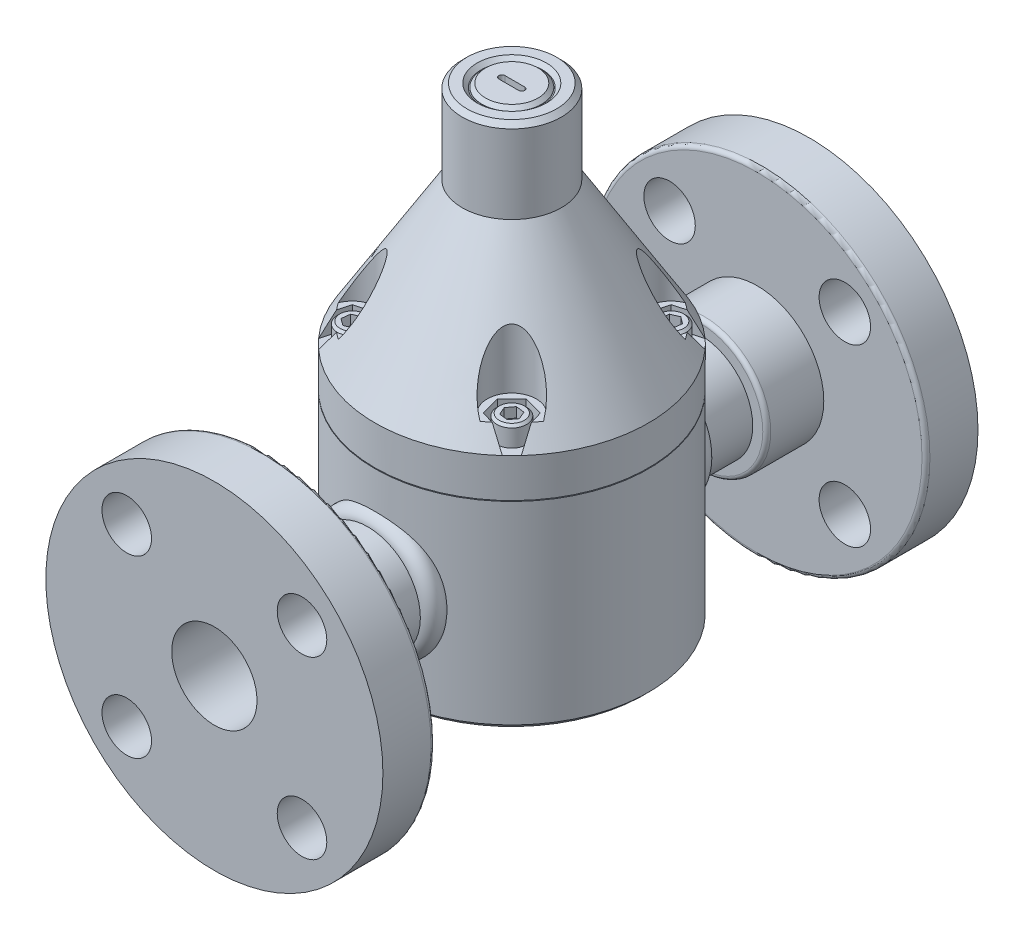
from build123d import *

# Parameters (mm, degrees)
SKETCH1_R                = 43.815
EXTRUDE1_DEPTH           = 148.59
CHAMFER1_SIZE            = 1.524
SKETCH3_R                = 11.1125
EXTRUDE2_DEPTH           = 1.27
EXTRUDE2_DRAFT           = -45
SKETCH4_R                = 9.525
EXTRUDE3_DEPTH           = 1.27
CHAMFER2_SIZE            = 1.143
EXTRUDE4_DEPTH           = 3.175
EXTRUDE4_DRAFT           = -1
SKETCH6_R                = 7.874
EXTRUDE5_DEPTH           = 22.86
EXTRUDE6_DEPTH           = 6.35
SKETCH8_R                = 4.7625
EXTRUDE7_DEPTH           = 6.35
EXTRUDE8_DEPTH           = 3.175
CIRPATTERN1_COUNT        = 4
CHAMFER3_SIZE            = 0.762
SKETCH10_R               = 53.975
BOSS_EXTRUDE1_DEPTH      = 16.6624
SKETCH11_R               = 21.4249
BOSS_EXTRUDE2_DEPTH      = 34.925
BOSS_EXTRUDE3_REACH      = 212.55
BOSS_EXTRUDE3_END_RADIUS = 43.815
SKETCH12_R               = 16.8275
SKETCH13_R               = 7.9375
CUT_EXTRUDE1_DEPTH       = 34.925
CIRPATTERN3_COUNT        = 4
SKETCH14_R               = 13.6525
CUT_EXTRUDE2_DEPTH       = 25.4
SKETCH15_R               = 54.046799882
BOSS_EXTRUDE4_DEPTH      = 16.6624
SKETCH16_R               = 21.323190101
BOSS_EXTRUDE5_DEPTH      = 34.925
BOSS_EXTRUDE6_REACH      = 249.569
BOSS_EXTRUDE6_END_RADIUS = 43.815
SKETCH17_R               = 16.8275
SKETCH18_R               = 8.236892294
CUT_EXTRUDE3_DEPTH       = 34.925
CIRPATTERN4_COUNT        = 4
FILLET1_R                = 1.27


with BuildPart() as part:
    # Sketch1 → Extrude1 (new body)
    with BuildSketch(Plane(origin=(0, 0, 0), x_dir=(1, 0, 0), z_dir=(0, 1, 0))):
        with Locations(Location((0, 0, 0), (0, 0, 270))):
            Circle(SKETCH1_R)
    extrude(amount=EXTRUDE1_DEPTH)

    # Sketch2 → Cut-Revolve1 (revolve, cut)
    with BuildSketch(Plane.XY, mode=Mode.PRIVATE) as cut_revolve1_sk:
        Polygon((-52.628834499, 63.5), (-30.226, 63.5), (-30.226, 63.754), (-43.815, 63.754), (-43.815, 76.2), (-15.875, 121.92), (-15.875, 152.4), (-52.628834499, 152.4), align=None)
    revolve(cut_revolve1_sk.sketch.rotate(Axis((0, 148.59, 0), (0, -1, 0)), 270), axis=Axis((0, 148.59, 0), (0, -1, 0)), mode=Mode.SUBTRACT)

    # Chamfer1
    chamfer1_edges = [part.edges().sort_by_distance(p)[0] for p in [
        (0, 0, -43.815),
        (0, 148.59, -15.875),
    ]]
    chamfer(chamfer1_edges, length=CHAMFER1_SIZE)


with BuildPart() as extrude2_tool:
    # Sketch3 → Extrude2 (with draft: the straight prism first)
    with BuildSketch(Plane(origin=(0, 148.59, 0), x_dir=(-1, 0, 0), z_dir=(0, 1, 0))):
        Circle(SKETCH3_R)
    extrude(amount=-EXTRUDE2_DEPTH)
    # Extrude2: the draft: its side faces are tilted about the plane it starts from
    extrude2_sides = [extrude2_tool.faces().sort_by_distance(p)[0] for p in [
        (11.1125, 147.955, 0),
    ]]
    draft(extrude2_sides, Plane(origin=(0, 148.59, 0), x_dir=(-1, 0, 0), z_dir=(0, 1, 0)), EXTRUDE2_DRAFT)


with BuildPart() as part_1:
    add(part.part)

    # Extrude2: cut by extrude2_tool
    add(extrude2_tool.part, mode=Mode.SUBTRACT)

    # Sketch4 → Extrude3 (add)
    with BuildSketch(Plane(origin=(0, 148.59, 0), x_dir=(-1, 0, 0), z_dir=(0, 1, 0))):
        with Locations(Location((0, 0, 0), (0, 0, 90))):
            Circle(SKETCH4_R)
    extrude(amount=-EXTRUDE3_DEPTH)

    # Chamfer2
    chamfer2_edges = [part_1.edges().sort_by_distance(p)[0] for p in [
        (0, 148.59, -9.525),
    ]]
    chamfer(chamfer2_edges, length=CHAMFER2_SIZE)


with BuildPart() as extrude4_tool:
    # Sketch5 → Extrude4 (with draft: the straight prism first)
    with BuildSketch(Plane(origin=(0, 148.59, 0), x_dir=(-1, 0, 0), z_dir=(0, 1, 0))):
        with BuildLine():
            Line((3.175, 0.9652), (-3.175, 0.9652))
            ThreePointArc((-3.175, 0.9652), (-4.1402, 0), (-3.175, -0.9652))
            Line((-3.175, -0.9652), (3.175, -0.9652))
            ThreePointArc((3.175, -0.9652), (4.1402, 0), (3.175, 0.9652))
        make_face()
    extrude(amount=-EXTRUDE4_DEPTH)
    # Extrude4: the draft: its side faces are tilted about the plane it starts from
    extrude4_sides = [extrude4_tool.faces().sort_by_distance(p)[0] for p in [
        (0, 147.0025, 0.9652),
        (4.1402, 147.0025, 0),
        (0, 147.0025, -0.9652),
        (-4.1402, 147.0025, 0),
    ]]
    draft(extrude4_sides, Plane(origin=(0, 148.59, 0), x_dir=(-1, 0, 0), z_dir=(0, 1, 0)), EXTRUDE4_DRAFT)


with BuildPart() as part_2:
    add(part_1.part)

    # Extrude4: cut by extrude4_tool
    add(extrude4_tool.part, mode=Mode.SUBTRACT)

    # Sketch6 → Extrude5 (cut)
    with BuildSketch(Plane(origin=(0, 82.55, 0), x_dir=(-1, 0, 0), z_dir=(0, 1, 0))):
        with Locations((-25.521887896, 25.521887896)):
            Circle(SKETCH6_R)
    extrude5 = extrude(amount=EXTRUDE5_DEPTH, mode=Mode.SUBTRACT)

    # Sketch7 → Extrude6 (cut)
    with BuildSketch(Plane(origin=(0, 82.55, 0), x_dir=(-1, 0, 0), z_dir=(0, 1, 0))):
        Polygon((-30.08447079, 20.959305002), (-23.85186665, 19.289283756), (-19.289283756, 23.85186665), (-20.959305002, 30.08447079), (-33.653634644, 33.653634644), align=None)
    extrude6 = extrude(amount=-EXTRUDE6_DEPTH, mode=Mode.SUBTRACT)

    # Sketch8 → Extrude7 (add)
    with BuildSketch(Plane(origin=(0, 82.55, 0), x_dir=(-1, 0, 0), z_dir=(0, 1, 0))):
        with Locations(Location((-25.521887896, 25.521887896, 0), (0, 0, 90))):
            Circle(SKETCH8_R)
    extrude7 = extrude(amount=-EXTRUDE7_DEPTH)

    # Sketch9 → Extrude8 (cut)
    with BuildSketch(Plane(origin=(0, 82.55, 0), x_dir=(-1, 0, 0), z_dir=(0, 1, 0))):
        Polygon((-23.873856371, 27.745151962), (-26.623275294, 28.060757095), (-28.271306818, 25.83749303), (-27.169919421, 23.298623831), (-24.420500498, 22.983018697), (-22.772468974, 25.206282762), align=None)
    extrude8 = extrude(amount=-EXTRUDE8_DEPTH, mode=Mode.SUBTRACT)

    # CirPattern1: Extrude5, Extrude6, Extrude7, Extrude8 ×4 about axis
    cirpattern1_axis = Axis((0, 0, 0), (0, 1, 0))
    add([extrude5.rotate(cirpattern1_axis, i * 360 / CIRPATTERN1_COUNT) for i in range(1, CIRPATTERN1_COUNT)], mode=Mode.SUBTRACT)
    add([extrude6.rotate(cirpattern1_axis, i * 360 / CIRPATTERN1_COUNT) for i in range(1, CIRPATTERN1_COUNT)], mode=Mode.SUBTRACT)
    add([extrude7.rotate(cirpattern1_axis, i * 360 / CIRPATTERN1_COUNT) for i in range(1, CIRPATTERN1_COUNT)])
    add([extrude8.rotate(cirpattern1_axis, i * 360 / CIRPATTERN1_COUNT) for i in range(1, CIRPATTERN1_COUNT)], mode=Mode.SUBTRACT)

    # Chamfer3
    chamfer3_edges = [part_2.edges().sort_by_distance(p)[0] for p in [
        (-20.759387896, 82.55, 25.521887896),
        (-25.521887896, 82.55, -20.759387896),
        (20.759387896, 82.55, -25.521887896),
        (25.521887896, 82.55, 20.759387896),
    ]]
    chamfer(chamfer3_edges, length=CHAMFER3_SIZE)



with BuildPart() as body_2:
    # Sketch10 → Boss-Extrude1 (new body)
    with BuildSketch(Plane.XY.offset(95.25)):
        with Locations((0, 31.75)):
            Circle(SKETCH10_R)
    extrude(amount=-BOSS_EXTRUDE1_DEPTH)

    # Sketch11 → Boss-Extrude2 (add)
    with BuildSketch(Plane.XY.offset(95.25)):
        with Locations((0, 31.75)):
            Circle(SKETCH11_R)
    extrude(amount=-BOSS_EXTRUDE2_DEPTH)


with BuildPart() as part_3:
    add(part_2.part)

    add(body_2.part)  # Boss-Extrude3 merges body 2
    # Boss-Extrude3: up to this cylinder (the profile starts outside it)
    boss_extrude3_end = Plane(origin=(0, 31.75, 0), z_dir=(0, -1, 0)) * Cylinder(BOSS_EXTRUDE3_END_RADIUS, 513.73, mode=Mode.PRIVATE)
    # Sketch12 → Boss-Extrude3 (add, up to the surface)
    with BuildSketch(Plane.XY.offset(95.25), mode=Mode.PRIVATE) as boss_extrude3_sk1:
        with Locations((0, 31.75)):
            Circle(SKETCH12_R)
    boss_extrude3_tool1 = extrude(boss_extrude3_sk1.sketch, amount=-BOSS_EXTRUDE3_REACH, mode=Mode.PRIVATE) - boss_extrude3_end
    add(boss_extrude3_tool1.solids().sort_by_distance((0, 31.75, 95.25))[0])

    # Sketch13 → Cut-Extrude1 (cut)
    with BuildSketch(Plane.XY.offset(95.25)):
        with Locations((-28.063300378, 59.813300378)):
            Circle(SKETCH13_R)
    cut_extrude1 = extrude(amount=-CUT_EXTRUDE1_DEPTH, mode=Mode.SUBTRACT)

    # CirPattern3: Cut-Extrude1 ×4 about axis
    cirpattern3_axis = Axis((0, 31.75, 0), (0, 0, 1))
    for i in range(1, CIRPATTERN3_COUNT):
        add(cut_extrude1.rotate(cirpattern3_axis, i * 360 / CIRPATTERN3_COUNT), mode=Mode.SUBTRACT)

    # Sketch14 → Cut-Extrude2 (cut)
    with BuildSketch(Plane.XY.offset(95.25)):
        with Locations((0, 31.75)):
            Circle(SKETCH14_R)
    extrude(amount=-CUT_EXTRUDE2_DEPTH, mode=Mode.SUBTRACT)



with BuildPart() as body_2_2:
    # Sketch15 → Boss-Extrude4 (new body)
    with BuildSketch(Plane.XY.offset(-95.25)):
        with Locations((0, 31.75)):
            Circle(SKETCH15_R)
    extrude(amount=BOSS_EXTRUDE4_DEPTH)

    # Sketch16 → Boss-Extrude5 (add)
    with BuildSketch(Plane.XY.offset(-95.25)):
        with Locations((0, 31.75)):
            Circle(SKETCH16_R)
    extrude(amount=BOSS_EXTRUDE5_DEPTH)


with BuildPart() as part_4:
    add(part_3.part)

    add(body_2_2.part)  # Boss-Extrude6 merges body 2 2
    # Boss-Extrude6: up to this cylinder (the profile starts outside it)
    boss_extrude6_end = Plane(origin=(0, 31.75, 0), z_dir=(0, -1, 0)) * Cylinder(BOSS_EXTRUDE6_END_RADIUS, 587.768, mode=Mode.PRIVATE)
    # Sketch17 → Boss-Extrude6 (add, up to the surface)
    with BuildSketch(Plane.XY.offset(-95.25), mode=Mode.PRIVATE) as boss_extrude6_sk1:
        with Locations((0, 31.75)):
            Circle(SKETCH17_R)
    boss_extrude6_tool1 = extrude(boss_extrude6_sk1.sketch, amount=BOSS_EXTRUDE6_REACH, mode=Mode.PRIVATE) - boss_extrude6_end
    add(boss_extrude6_tool1.solids().sort_by_distance((0, 31.75, -95.25))[0])

    # Sketch18 → Cut-Extrude3 (cut)
    with BuildSketch(Plane.XY.offset(-95.25)):
        with Locations((28.063300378, 59.813300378)):
            Circle(SKETCH18_R)
    cut_extrude3 = extrude(amount=CUT_EXTRUDE3_DEPTH, mode=Mode.SUBTRACT)

    # CirPattern4: Cut-Extrude3 ×4 about axis
    cirpattern4_axis = Axis((0, 31.75, 0), (0, 0, 1))
    for i in range(1, CIRPATTERN4_COUNT):
        add(cut_extrude3.rotate(cirpattern4_axis, i * 360 / CIRPATTERN4_COUNT), mode=Mode.SUBTRACT)

    # Fillet1
    fillet1_edges = [part_4.edges().sort_by_distance(p)[0] for p in [
        (-53.975, 31.75, 78.5876),
        (-21.4249, 31.75, 60.325),
        (-21.323190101, 31.75, -60.325),
        (-54.046799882, 31.75, -78.5876),
    ]]
    fillet(fillet1_edges, radius=FILLET1_R)

    # Sketch19 → Revolve1 (revolve)
    with BuildSketch(Plane(origin=(0, 0, 0), x_dir=(0, 0, -1), z_dir=(1, 0, 0)), mode=Mode.PRIVATE) as revolve1_sk:
        with BuildLine():
            Line((-46.147022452, 46.327866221), (-46.147022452, 48.210883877))
            ThreePointArc((-46.147022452, 48.210883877), (-42.587276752, 51.938056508), (-38.700543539, 48.553250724))
            Line((-38.700543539, 48.553250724), (-38.700543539, 44.273665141))
            Line((-38.700543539, 44.273665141), (-46.147022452, 46.327866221))
        make_face()
    revolve1 = revolve(revolve1_sk.sketch.rotate(Axis((0, 31.843927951, 59.363719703), (0, 0, -1)), 229.501992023), axis=Axis((0, 31.843927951, 59.363719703), (0, 0, -1)))

    # Mirror2: Revolve1 across plane
    add(revolve1.mirror(Plane.XY))


solid = part_4.part
